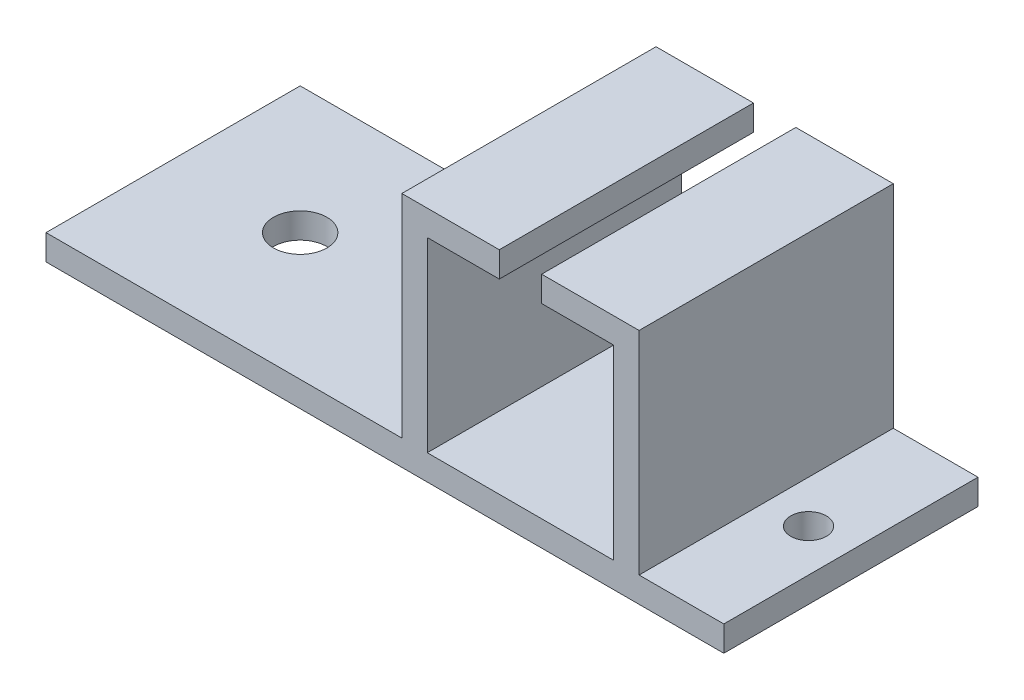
ISO-10303-21;
HEADER;
FILE_DESCRIPTION(('STEP AP214'),'2;1');
FILE_NAME('part.step','',(''),(''),'','','');
FILE_SCHEMA(('AUTOMOTIVE_DESIGN { 1 0 10303 214 1 1 1 1 }'));
ENDSEC;
DATA;
#1=APPLICATION_CONTEXT('core data for automotive mechanical design processes');
#2=APPLICATION_PROTOCOL_DEFINITION('international standard','automotive_design',2000,#1);
#3=PRODUCT_CONTEXT('',#1,'mechanical');
#4=PRODUCT('Part','Part','',(#3));
#5=PRODUCT_RELATED_PRODUCT_CATEGORY('part','',(#4));
#6=PRODUCT_DEFINITION_FORMATION('','',#4);
#7=PRODUCT_DEFINITION_CONTEXT('part definition',#1,'design');
#8=PRODUCT_DEFINITION('design','',#6,#7);
#9=PRODUCT_DEFINITION_SHAPE('','',#8);
#10=(LENGTH_UNIT() NAMED_UNIT(*) SI_UNIT(.MILLI.,.METRE.));
#11=(NAMED_UNIT(*) PLANE_ANGLE_UNIT() SI_UNIT($,.RADIAN.));
#12=(NAMED_UNIT(*) SI_UNIT($,.STERADIAN.) SOLID_ANGLE_UNIT());
#13=UNCERTAINTY_MEASURE_WITH_UNIT(LENGTH_MEASURE(1.E-05),#10,'distance_accuracy_value','');
#14=(GEOMETRIC_REPRESENTATION_CONTEXT(3) GLOBAL_UNCERTAINTY_ASSIGNED_CONTEXT((#13)) GLOBAL_UNIT_ASSIGNED_CONTEXT((#10,
#11,#12)) REPRESENTATION_CONTEXT('',''));
#15=CARTESIAN_POINT('',(0.,0.,0.));
#16=DIRECTION('',(0.,0.,1.));
#17=DIRECTION('',(1.,0.,0.));
#18=AXIS2_PLACEMENT_3D('',#15,#16,#17);
#19=CARTESIAN_POINT('',(0.,26.5,0.));
#20=DIRECTION('',(0.,1.,0.));
#21=DIRECTION('',(0.,0.,1.));
#22=AXIS2_PLACEMENT_3D('',#19,#20,#21);
#23=PLANE('',#22);
#24=DIRECTION('',(0.,0.,1.));
#25=VECTOR('',#24,1.);
#26=CARTESIAN_POINT('',(13.5,26.5,-15.));
#27=LINE('',#26,#25);
#28=CARTESIAN_POINT('',(13.5,26.5,-15.));
#29=VERTEX_POINT('',#28);
#30=CARTESIAN_POINT('',(13.5,26.5,15.));
#31=VERTEX_POINT('',#30);
#32=EDGE_CURVE('E154',#29,#31,#27,.T.);
#33=ORIENTED_EDGE('',*,*,#32,.F.);
#34=DIRECTION('',(-1.,0.,0.));
#35=VECTOR('',#34,1.);
#36=CARTESIAN_POINT('',(1.99999999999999,26.5,-15.));
#37=LINE('',#36,#35);
#38=CARTESIAN_POINT('',(1.99999999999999,26.5,-15.));
#39=VERTEX_POINT('',#38);
#40=EDGE_CURVE('E263',#29,#39,#37,.T.);
#41=ORIENTED_EDGE('',*,*,#40,.T.);
#42=DIRECTION('',(0.,0.,1.));
#43=VECTOR('',#42,1.);
#44=CARTESIAN_POINT('',(1.99999999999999,26.5,-15.));
#45=LINE('',#44,#43);
#46=CARTESIAN_POINT('',(1.99999999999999,26.5,15.));
#47=VERTEX_POINT('',#46);
#48=EDGE_CURVE('E170',#39,#47,#45,.T.);
#49=ORIENTED_EDGE('',*,*,#48,.T.);
#50=DIRECTION('',(1.,0.,0.));
#51=VECTOR('',#50,1.);
#52=CARTESIAN_POINT('',(1.99999999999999,26.5,15.));
#53=LINE('',#52,#51);
#54=EDGE_CURVE('E169',#47,#31,#53,.T.);
#55=ORIENTED_EDGE('',*,*,#54,.T.);
#56=EDGE_LOOP('',(#33,#41,#49,#55));
#57=FACE_BOUND('',#56,.T.);
#58=ADVANCED_FACE('F36',(#57),#23,.T.);
#59=CARTESIAN_POINT('',(4.99999999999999,23.5,-15.));
#60=DIRECTION('',(0.,1.,0.));
#61=DIRECTION('',(0.,0.,1.));
#62=AXIS2_PLACEMENT_3D('',#59,#60,#61);
#63=PLANE('',#62);
#64=DIRECTION('',(-1.,0.,0.));
#65=VECTOR('',#64,1.);
#66=CARTESIAN_POINT('',(4.99999999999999,23.5,-15.));
#67=LINE('',#66,#65);
#68=CARTESIAN_POINT('',(13.5,23.5,-15.));
#69=VERTEX_POINT('',#68);
#70=CARTESIAN_POINT('',(4.99999999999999,23.5,-15.));
#71=VERTEX_POINT('',#70);
#72=EDGE_CURVE('E238',#69,#71,#67,.T.);
#73=ORIENTED_EDGE('',*,*,#72,.F.);
#74=DIRECTION('',(0.,0.,1.));
#75=VECTOR('',#74,1.);
#76=CARTESIAN_POINT('',(13.5,23.5,-15.));
#77=LINE('',#76,#75);
#78=CARTESIAN_POINT('',(13.5,23.5,15.));
#79=VERTEX_POINT('',#78);
#80=EDGE_CURVE('E11',#69,#79,#77,.T.);
#81=ORIENTED_EDGE('',*,*,#80,.T.);
#82=DIRECTION('',(-1.,0.,0.));
#83=VECTOR('',#82,1.);
#84=CARTESIAN_POINT('',(4.99999999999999,23.5,15.));
#85=LINE('',#84,#83);
#86=CARTESIAN_POINT('',(4.99999999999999,23.5,15.));
#87=VERTEX_POINT('',#86);
#88=EDGE_CURVE('E255',#79,#87,#85,.T.);
#89=ORIENTED_EDGE('',*,*,#88,.T.);
#90=DIRECTION('',(0.,0.,1.));
#91=VECTOR('',#90,1.);
#92=CARTESIAN_POINT('',(4.99999999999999,23.5,-15.));
#93=LINE('',#92,#91);
#94=EDGE_CURVE('E180',#71,#87,#93,.T.);
#95=ORIENTED_EDGE('',*,*,#94,.F.);
#96=EDGE_LOOP('',(#73,#81,#89,#95));
#97=FACE_BOUND('',#96,.T.);
#98=ADVANCED_FACE('F310',(#97),#63,.F.);
#99=CARTESIAN_POINT('',(-40.,1.5,15.));
#100=DIRECTION('',(0.,-1.,0.));
#101=DIRECTION('',(0.,0.,-1.));
#102=AXIS2_PLACEMENT_3D('',#99,#100,#101);
#103=PLANE('',#102);
#104=CARTESIAN_POINT('',(35.,1.5,0.));
#105=DIRECTION('',(0.,1.,0.));
#106=DIRECTION('',(0.,0.,1.));
#107=AXIS2_PLACEMENT_3D('',#104,#105,#106);
#108=CIRCLE('',#107,2.1);
#109=CARTESIAN_POINT('',(35.,1.5,2.1));
#110=VERTEX_POINT('',#109);
#111=EDGE_CURVE('E288',#110,#110,#108,.T.);
#112=ORIENTED_EDGE('',*,*,#111,.F.);
#113=EDGE_LOOP('',(#112));
#114=FACE_BOUND('',#113,.T.);
#115=DIRECTION('',(0.,0.,-1.));
#116=VECTOR('',#115,1.);
#117=CARTESIAN_POINT('',(30.,1.5,-15.));
#118=LINE('',#117,#116);
#119=CARTESIAN_POINT('',(30.,1.5,15.));
#120=VERTEX_POINT('',#119);
#121=CARTESIAN_POINT('',(30.,1.5,-15.));
#122=VERTEX_POINT('',#121);
#123=EDGE_CURVE('E176',#120,#122,#118,.T.);
#124=ORIENTED_EDGE('',*,*,#123,.F.);
#125=DIRECTION('',(-1.,0.,0.));
#126=VECTOR('',#125,1.);
#127=CARTESIAN_POINT('',(-40.,1.5,15.));
#128=LINE('',#127,#126);
#129=CARTESIAN_POINT('',(40.,1.5,15.));
#130=VERTEX_POINT('',#129);
#131=EDGE_CURVE('E200',#130,#120,#128,.T.);
#132=ORIENTED_EDGE('',*,*,#131,.F.);
#133=DIRECTION('',(0.,0.,-1.));
#134=VECTOR('',#133,1.);
#135=CARTESIAN_POINT('',(40.,1.5,15.));
#136=LINE('',#135,#134);
#137=CARTESIAN_POINT('',(40.,1.5,-15.));
#138=VERTEX_POINT('',#137);
#139=EDGE_CURVE('E223',#130,#138,#136,.T.);
#140=ORIENTED_EDGE('',*,*,#139,.T.);
#141=DIRECTION('',(-1.,0.,0.));
#142=VECTOR('',#141,1.);
#143=CARTESIAN_POINT('',(-40.,1.5,-15.));
#144=LINE('',#143,#142);
#145=EDGE_CURVE('E210',#138,#122,#144,.T.);
#146=ORIENTED_EDGE('',*,*,#145,.T.);
#147=EDGE_LOOP('',(#124,#132,#140,#146));
#148=FACE_BOUND('',#147,.T.);
#149=ADVANCED_FACE('F324',(#114,#148),#103,.F.);
#150=CARTESIAN_POINT('',(-25.,1.5,0.));
#151=DIRECTION('',(0.,1.,0.));
#152=DIRECTION('',(0.,0.,1.));
#153=AXIS2_PLACEMENT_3D('',#150,#151,#152);
#154=CIRCLE('',#153,3.15);
#155=CARTESIAN_POINT('',(-25.,1.5,3.15));
#156=VERTEX_POINT('',#155);
#157=EDGE_CURVE('E277',#156,#156,#154,.T.);
#158=ORIENTED_EDGE('',*,*,#157,.F.);
#159=EDGE_LOOP('',(#158));
#160=FACE_BOUND('',#159,.T.);
#161=DIRECTION('',(0.,0.,1.));
#162=VECTOR('',#161,1.);
#163=CARTESIAN_POINT('',(1.99999999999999,1.5,-15.));
#164=LINE('',#163,#162);
#165=CARTESIAN_POINT('',(1.99999999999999,1.5,-15.));
#166=VERTEX_POINT('',#165);
#167=CARTESIAN_POINT('',(1.99999999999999,1.5,15.));
#168=VERTEX_POINT('',#167);
#169=EDGE_CURVE('E179',#166,#168,#164,.T.);
#170=ORIENTED_EDGE('',*,*,#169,.F.);
#171=CARTESIAN_POINT('',(-40.,1.5,-15.));
#172=VERTEX_POINT('',#171);
#173=EDGE_CURVE('E209',#166,#172,#144,.T.);
#174=ORIENTED_EDGE('',*,*,#173,.T.);
#175=DIRECTION('',(0.,0.,-1.));
#176=VECTOR('',#175,1.);
#177=CARTESIAN_POINT('',(-40.,1.5,15.));
#178=LINE('',#177,#176);
#179=CARTESIAN_POINT('',(-40.,1.5,15.));
#180=VERTEX_POINT('',#179);
#181=EDGE_CURVE('E220',#180,#172,#178,.T.);
#182=ORIENTED_EDGE('',*,*,#181,.F.);
#183=EDGE_CURVE('E198',#168,#180,#128,.T.);
#184=ORIENTED_EDGE('',*,*,#183,.F.);
#185=EDGE_LOOP('',(#170,#174,#182,#184));
#186=FACE_BOUND('',#185,.T.);
#187=ADVANCED_FACE('F352',(#160,#186),#103,.F.);
#188=CARTESIAN_POINT('',(40.,1.5,15.));
#189=DIRECTION('',(-1.,0.,0.));
#190=DIRECTION('',(0.,0.,1.));
#191=AXIS2_PLACEMENT_3D('',#188,#189,#190);
#192=PLANE('',#191);
#193=DIRECTION('',(0.,1.,0.));
#194=VECTOR('',#193,1.);
#195=CARTESIAN_POINT('',(40.,1.5,-15.));
#196=LINE('',#195,#194);
#197=CARTESIAN_POINT('',(40.,-1.5,-15.));
#198=VERTEX_POINT('',#197);
#199=EDGE_CURVE('E194',#198,#138,#196,.T.);
#200=ORIENTED_EDGE('',*,*,#199,.T.);
#201=ORIENTED_EDGE('',*,*,#139,.F.);
#202=DIRECTION('',(0.,1.,0.));
#203=VECTOR('',#202,1.);
#204=CARTESIAN_POINT('',(40.,1.5,15.));
#205=LINE('',#204,#203);
#206=CARTESIAN_POINT('',(40.,-1.5,15.));
#207=VERTEX_POINT('',#206);
#208=EDGE_CURVE('E195',#207,#130,#205,.T.);
#209=ORIENTED_EDGE('',*,*,#208,.F.);
#210=DIRECTION('',(0.,0.,-1.));
#211=VECTOR('',#210,1.);
#212=CARTESIAN_POINT('',(40.,-1.5,15.));
#213=LINE('',#212,#211);
#214=EDGE_CURVE('E206',#207,#198,#213,.T.);
#215=ORIENTED_EDGE('',*,*,#214,.T.);
#216=EDGE_LOOP('',(#200,#201,#209,#215));
#217=FACE_BOUND('',#216,.T.);
#218=ADVANCED_FACE('F38',(#217),#192,.F.);
#219=CARTESIAN_POINT('',(-40.,1.5,15.));
#220=DIRECTION('',(1.,0.,0.));
#221=DIRECTION('',(0.,0.,-1.));
#222=AXIS2_PLACEMENT_3D('',#219,#220,#221);
#223=PLANE('',#222);
#224=DIRECTION('',(0.,-1.,0.));
#225=VECTOR('',#224,1.);
#226=CARTESIAN_POINT('',(-40.,1.5,-15.));
#227=LINE('',#226,#225);
#228=CARTESIAN_POINT('',(-40.,-1.5,-15.));
#229=VERTEX_POINT('',#228);
#230=EDGE_CURVE('E212',#172,#229,#227,.T.);
#231=ORIENTED_EDGE('',*,*,#230,.T.);
#232=DIRECTION('',(0.,0.,-1.));
#233=VECTOR('',#232,1.);
#234=CARTESIAN_POINT('',(-40.,-1.5,15.));
#235=LINE('',#234,#233);
#236=CARTESIAN_POINT('',(-40.,-1.5,15.));
#237=VERTEX_POINT('',#236);
#238=EDGE_CURVE('E217',#237,#229,#235,.T.);
#239=ORIENTED_EDGE('',*,*,#238,.F.);
#240=DIRECTION('',(0.,-1.,0.));
#241=VECTOR('',#240,1.);
#242=CARTESIAN_POINT('',(-40.,1.5,15.));
#243=LINE('',#242,#241);
#244=EDGE_CURVE('E202',#180,#237,#243,.T.);
#245=ORIENTED_EDGE('',*,*,#244,.F.);
#246=ORIENTED_EDGE('',*,*,#181,.T.);
#247=EDGE_LOOP('',(#231,#239,#245,#246));
#248=FACE_BOUND('',#247,.T.);
#249=ADVANCED_FACE('F347',(#248),#223,.F.);
#250=CARTESIAN_POINT('',(-40.,-1.5,15.));
#251=DIRECTION('',(0.,1.,0.));
#252=DIRECTION('',(0.,0.,1.));
#253=AXIS2_PLACEMENT_3D('',#250,#251,#252);
#254=PLANE('',#253);
#255=CARTESIAN_POINT('',(-25.,-1.5,0.));
#256=DIRECTION('',(0.,1.,0.));
#257=DIRECTION('',(0.,0.,1.));
#258=AXIS2_PLACEMENT_3D('',#255,#256,#257);
#259=CIRCLE('',#258,3.15);
#260=CARTESIAN_POINT('',(-25.,-1.5,3.15));
#261=VERTEX_POINT('',#260);
#262=EDGE_CURVE('E281',#261,#261,#259,.T.);
#263=ORIENTED_EDGE('',*,*,#262,.T.);
#264=EDGE_LOOP('',(#263));
#265=FACE_BOUND('',#264,.T.);
#266=CARTESIAN_POINT('',(35.,-1.5,0.));
#267=DIRECTION('',(0.,1.,0.));
#268=DIRECTION('',(0.,0.,1.));
#269=AXIS2_PLACEMENT_3D('',#266,#267,#268);
#270=CIRCLE('',#269,2.1);
#271=CARTESIAN_POINT('',(35.,-1.5,2.1));
#272=VERTEX_POINT('',#271);
#273=EDGE_CURVE('E249',#272,#272,#270,.T.);
#274=ORIENTED_EDGE('',*,*,#273,.T.);
#275=EDGE_LOOP('',(#274));
#276=FACE_BOUND('',#275,.T.);
#277=DIRECTION('',(1.,0.,0.));
#278=VECTOR('',#277,1.);
#279=CARTESIAN_POINT('',(-40.,-1.5,-15.));
#280=LINE('',#279,#278);
#281=EDGE_CURVE('E199',#229,#198,#280,.T.);
#282=ORIENTED_EDGE('',*,*,#281,.T.);
#283=ORIENTED_EDGE('',*,*,#214,.F.);
#284=DIRECTION('',(1.,0.,0.));
#285=VECTOR('',#284,1.);
#286=CARTESIAN_POINT('',(-40.,-1.5,15.));
#287=LINE('',#286,#285);
#288=EDGE_CURVE('E204',#237,#207,#287,.T.);
#289=ORIENTED_EDGE('',*,*,#288,.F.);
#290=ORIENTED_EDGE('',*,*,#238,.T.);
#291=EDGE_LOOP('',(#282,#283,#289,#290));
#292=FACE_BOUND('',#291,.T.);
#293=ADVANCED_FACE('F342',(#265,#276,#292),#254,.F.);
#294=CARTESIAN_POINT('',(0.,0.,15.));
#295=DIRECTION('',(0.,0.,1.));
#296=DIRECTION('',(1.,0.,0.));
#297=AXIS2_PLACEMENT_3D('',#294,#295,#296);
#298=PLANE('',#297);
#299=DIRECTION('',(0.,1.,0.));
#300=VECTOR('',#299,1.);
#301=CARTESIAN_POINT('',(13.5,16.5,15.));
#302=LINE('',#301,#300);
#303=EDGE_CURVE('E59',#79,#31,#302,.T.);
#304=ORIENTED_EDGE('',*,*,#303,.T.);
#305=ORIENTED_EDGE('',*,*,#54,.F.);
#306=DIRECTION('',(0.,-1.,0.));
#307=VECTOR('',#306,1.);
#308=CARTESIAN_POINT('',(1.99999999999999,26.5,15.));
#309=LINE('',#308,#307);
#310=EDGE_CURVE('E185',#47,#168,#309,.T.);
#311=ORIENTED_EDGE('',*,*,#310,.T.);
#312=ORIENTED_EDGE('',*,*,#183,.T.);
#313=ORIENTED_EDGE('',*,*,#244,.T.);
#314=ORIENTED_EDGE('',*,*,#288,.T.);
#315=ORIENTED_EDGE('',*,*,#208,.T.);
#316=ORIENTED_EDGE('',*,*,#131,.T.);
#317=DIRECTION('',(0.,-1.,0.));
#318=VECTOR('',#317,1.);
#319=CARTESIAN_POINT('',(30.,26.5,15.));
#320=LINE('',#319,#318);
#321=CARTESIAN_POINT('',(30.,26.5,15.));
#322=VERTEX_POINT('',#321);
#323=EDGE_CURVE('E167',#322,#120,#320,.T.);
#324=ORIENTED_EDGE('',*,*,#323,.F.);
#325=CARTESIAN_POINT('',(18.5,26.5,15.));
#326=VERTEX_POINT('',#325);
#327=EDGE_CURVE('E160',#326,#322,#53,.T.);
#328=ORIENTED_EDGE('',*,*,#327,.F.);
#329=DIRECTION('',(0.,1.,0.));
#330=VECTOR('',#329,1.);
#331=CARTESIAN_POINT('',(18.5,16.5,15.));
#332=LINE('',#331,#330);
#333=CARTESIAN_POINT('',(18.5,23.5,15.));
#334=VERTEX_POINT('',#333);
#335=EDGE_CURVE('E146',#334,#326,#332,.T.);
#336=ORIENTED_EDGE('',*,*,#335,.F.);
#337=CARTESIAN_POINT('',(27.,23.5,15.));
#338=VERTEX_POINT('',#337);
#339=EDGE_CURVE('E231',#338,#334,#85,.T.);
#340=ORIENTED_EDGE('',*,*,#339,.F.);
#341=DIRECTION('',(0.,1.,0.));
#342=VECTOR('',#341,1.);
#343=CARTESIAN_POINT('',(27.,23.5,15.));
#344=LINE('',#343,#342);
#345=CARTESIAN_POINT('',(27.,1.5,15.));
#346=VERTEX_POINT('',#345);
#347=EDGE_CURVE('E252',#346,#338,#344,.T.);
#348=ORIENTED_EDGE('',*,*,#347,.F.);
#349=DIRECTION('',(1.,0.,0.));
#350=VECTOR('',#349,1.);
#351=CARTESIAN_POINT('',(5.,1.5,15.));
#352=LINE('',#351,#350);
#353=CARTESIAN_POINT('',(5.,1.5,15.));
#354=VERTEX_POINT('',#353);
#355=EDGE_CURVE('E248',#354,#346,#352,.T.);
#356=ORIENTED_EDGE('',*,*,#355,.F.);
#357=DIRECTION('',(0.,-1.,0.));
#358=VECTOR('',#357,1.);
#359=CARTESIAN_POINT('',(4.99999999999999,23.5,15.));
#360=LINE('',#359,#358);
#361=EDGE_CURVE('E246',#87,#354,#360,.T.);
#362=ORIENTED_EDGE('',*,*,#361,.F.);
#363=ORIENTED_EDGE('',*,*,#88,.F.);
#364=EDGE_LOOP('',(#304,#305,#311,#312,#313,#314,#315,#316,#324,#328,#336,#340,#348,#356,#362,#363));
#365=FACE_BOUND('',#364,.T.);
#366=ADVANCED_FACE('F164',(#365),#298,.T.);
#367=CARTESIAN_POINT('',(0.,0.,-15.));
#368=DIRECTION('',(0.,0.,1.));
#369=DIRECTION('',(1.,0.,0.));
#370=AXIS2_PLACEMENT_3D('',#367,#368,#369);
#371=PLANE('',#370);
#372=ORIENTED_EDGE('',*,*,#40,.F.);
#373=DIRECTION('',(0.,1.,0.));
#374=VECTOR('',#373,1.);
#375=CARTESIAN_POINT('',(13.5,16.5,-15.));
#376=LINE('',#375,#374);
#377=EDGE_CURVE('E278',#69,#29,#376,.T.);
#378=ORIENTED_EDGE('',*,*,#377,.F.);
#379=ORIENTED_EDGE('',*,*,#72,.T.);
#380=DIRECTION('',(0.,-1.,0.));
#381=VECTOR('',#380,1.);
#382=CARTESIAN_POINT('',(4.99999999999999,23.5,-15.));
#383=LINE('',#382,#381);
#384=CARTESIAN_POINT('',(5.,1.5,-15.));
#385=VERTEX_POINT('',#384);
#386=EDGE_CURVE('E257',#71,#385,#383,.T.);
#387=ORIENTED_EDGE('',*,*,#386,.T.);
#388=DIRECTION('',(1.,0.,0.));
#389=VECTOR('',#388,1.);
#390=CARTESIAN_POINT('',(5.,1.5,-15.));
#391=LINE('',#390,#389);
#392=CARTESIAN_POINT('',(27.,1.5,-15.));
#393=VERTEX_POINT('',#392);
#394=EDGE_CURVE('E295',#385,#393,#391,.T.);
#395=ORIENTED_EDGE('',*,*,#394,.T.);
#396=DIRECTION('',(0.,1.,0.));
#397=VECTOR('',#396,1.);
#398=CARTESIAN_POINT('',(27.,23.5,-15.));
#399=LINE('',#398,#397);
#400=CARTESIAN_POINT('',(27.,23.5,-15.));
#401=VERTEX_POINT('',#400);
#402=EDGE_CURVE('E236',#393,#401,#399,.T.);
#403=ORIENTED_EDGE('',*,*,#402,.T.);
#404=CARTESIAN_POINT('',(18.5,23.5,-15.));
#405=VERTEX_POINT('',#404);
#406=EDGE_CURVE('E229',#401,#405,#67,.T.);
#407=ORIENTED_EDGE('',*,*,#406,.T.);
#408=DIRECTION('',(0.,1.,0.));
#409=VECTOR('',#408,1.);
#410=CARTESIAN_POINT('',(18.5,16.5,-15.));
#411=LINE('',#410,#409);
#412=CARTESIAN_POINT('',(18.5,26.5,-15.));
#413=VERTEX_POINT('',#412);
#414=EDGE_CURVE('E51',#405,#413,#411,.T.);
#415=ORIENTED_EDGE('',*,*,#414,.T.);
#416=CARTESIAN_POINT('',(30.,26.5,-15.));
#417=VERTEX_POINT('',#416);
#418=EDGE_CURVE('E162',#417,#413,#37,.T.);
#419=ORIENTED_EDGE('',*,*,#418,.F.);
#420=DIRECTION('',(0.,-1.,0.));
#421=VECTOR('',#420,1.);
#422=CARTESIAN_POINT('',(30.,26.5,-15.));
#423=LINE('',#422,#421);
#424=EDGE_CURVE('E191',#417,#122,#423,.T.);
#425=ORIENTED_EDGE('',*,*,#424,.T.);
#426=ORIENTED_EDGE('',*,*,#145,.F.);
#427=ORIENTED_EDGE('',*,*,#199,.F.);
#428=ORIENTED_EDGE('',*,*,#281,.F.);
#429=ORIENTED_EDGE('',*,*,#230,.F.);
#430=ORIENTED_EDGE('',*,*,#173,.F.);
#431=DIRECTION('',(0.,-1.,0.));
#432=VECTOR('',#431,1.);
#433=CARTESIAN_POINT('',(1.99999999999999,26.5,-15.));
#434=LINE('',#433,#432);
#435=EDGE_CURVE('E188',#39,#166,#434,.T.);
#436=ORIENTED_EDGE('',*,*,#435,.F.);
#437=EDGE_LOOP('',(#372,#378,#379,#387,#395,#403,#407,#415,#419,#425,#426,#427,#428,#429,#430,#436));
#438=FACE_BOUND('',#437,.T.);
#439=ADVANCED_FACE('F234',(#438),#371,.F.);
#440=CARTESIAN_POINT('',(30.,26.5,-15.));
#441=DIRECTION('',(-1.,0.,0.));
#442=DIRECTION('',(0.,0.,1.));
#443=AXIS2_PLACEMENT_3D('',#440,#441,#442);
#444=PLANE('',#443);
#445=ORIENTED_EDGE('',*,*,#123,.T.);
#446=ORIENTED_EDGE('',*,*,#424,.F.);
#447=DIRECTION('',(0.,0.,-1.));
#448=VECTOR('',#447,1.);
#449=CARTESIAN_POINT('',(30.,26.5,-15.));
#450=LINE('',#449,#448);
#451=EDGE_CURVE('E183',#322,#417,#450,.T.);
#452=ORIENTED_EDGE('',*,*,#451,.F.);
#453=ORIENTED_EDGE('',*,*,#323,.T.);
#454=EDGE_LOOP('',(#445,#446,#452,#453));
#455=FACE_BOUND('',#454,.T.);
#456=ADVANCED_FACE('F333',(#455),#444,.F.);
#457=CARTESIAN_POINT('',(1.99999999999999,26.5,-15.));
#458=DIRECTION('',(1.,0.,0.));
#459=DIRECTION('',(0.,0.,-1.));
#460=AXIS2_PLACEMENT_3D('',#457,#458,#459);
#461=PLANE('',#460);
#462=ORIENTED_EDGE('',*,*,#169,.T.);
#463=ORIENTED_EDGE('',*,*,#310,.F.);
#464=ORIENTED_EDGE('',*,*,#48,.F.);
#465=ORIENTED_EDGE('',*,*,#435,.T.);
#466=EDGE_LOOP('',(#462,#463,#464,#465));
#467=FACE_BOUND('',#466,.T.);
#468=ADVANCED_FACE('F273',(#467),#461,.F.);
#469=DIRECTION('',(0.,0.,-1.));
#470=VECTOR('',#469,1.);
#471=CARTESIAN_POINT('',(18.5,26.5,-15.));
#472=LINE('',#471,#470);
#473=EDGE_CURVE('E149',#326,#413,#472,.T.);
#474=ORIENTED_EDGE('',*,*,#473,.F.);
#475=ORIENTED_EDGE('',*,*,#327,.T.);
#476=ORIENTED_EDGE('',*,*,#451,.T.);
#477=ORIENTED_EDGE('',*,*,#418,.T.);
#478=EDGE_LOOP('',(#474,#475,#476,#477));
#479=FACE_BOUND('',#478,.T.);
#480=ADVANCED_FACE('F158',(#479),#23,.T.);
#481=CARTESIAN_POINT('',(4.99999999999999,23.5,-15.));
#482=DIRECTION('',(-1.,0.,0.));
#483=DIRECTION('',(0.,-1.,0.));
#484=AXIS2_PLACEMENT_3D('',#481,#482,#483);
#485=PLANE('',#484);
#486=ORIENTED_EDGE('',*,*,#361,.T.);
#487=DIRECTION('',(0.,0.,1.));
#488=VECTOR('',#487,1.);
#489=CARTESIAN_POINT('',(5.,1.5,-15.));
#490=LINE('',#489,#488);
#491=EDGE_CURVE('E237',#385,#354,#490,.T.);
#492=ORIENTED_EDGE('',*,*,#491,.F.);
#493=ORIENTED_EDGE('',*,*,#386,.F.);
#494=ORIENTED_EDGE('',*,*,#94,.T.);
#495=EDGE_LOOP('',(#486,#492,#493,#494));
#496=FACE_BOUND('',#495,.T.);
#497=ADVANCED_FACE('F306',(#496),#485,.F.);
#498=ORIENTED_EDGE('',*,*,#339,.T.);
#499=DIRECTION('',(0.,0.,-1.));
#500=VECTOR('',#499,1.);
#501=CARTESIAN_POINT('',(18.5,23.5,-15.));
#502=LINE('',#501,#500);
#503=EDGE_CURVE('E44',#334,#405,#502,.T.);
#504=ORIENTED_EDGE('',*,*,#503,.T.);
#505=ORIENTED_EDGE('',*,*,#406,.F.);
#506=DIRECTION('',(0.,0.,1.));
#507=VECTOR('',#506,1.);
#508=CARTESIAN_POINT('',(27.,23.5,-15.));
#509=LINE('',#508,#507);
#510=EDGE_CURVE('E260',#401,#338,#509,.T.);
#511=ORIENTED_EDGE('',*,*,#510,.T.);
#512=EDGE_LOOP('',(#498,#504,#505,#511));
#513=FACE_BOUND('',#512,.T.);
#514=ADVANCED_FACE('F228',(#513),#63,.F.);
#515=CARTESIAN_POINT('',(27.,23.5,-15.));
#516=DIRECTION('',(1.,0.,0.));
#517=DIRECTION('',(0.,1.,0.));
#518=AXIS2_PLACEMENT_3D('',#515,#516,#517);
#519=PLANE('',#518);
#520=ORIENTED_EDGE('',*,*,#347,.T.);
#521=ORIENTED_EDGE('',*,*,#510,.F.);
#522=ORIENTED_EDGE('',*,*,#402,.F.);
#523=DIRECTION('',(0.,0.,1.));
#524=VECTOR('',#523,1.);
#525=CARTESIAN_POINT('',(27.,1.5,-15.));
#526=LINE('',#525,#524);
#527=EDGE_CURVE('E241',#393,#346,#526,.T.);
#528=ORIENTED_EDGE('',*,*,#527,.T.);
#529=EDGE_LOOP('',(#520,#521,#522,#528));
#530=FACE_BOUND('',#529,.T.);
#531=ADVANCED_FACE('F304',(#530),#519,.F.);
#532=CARTESIAN_POINT('',(5.,1.5,-15.));
#533=DIRECTION('',(0.,-1.,0.));
#534=DIRECTION('',(1.,0.,0.));
#535=AXIS2_PLACEMENT_3D('',#532,#533,#534);
#536=PLANE('',#535);
#537=ORIENTED_EDGE('',*,*,#355,.T.);
#538=ORIENTED_EDGE('',*,*,#527,.F.);
#539=ORIENTED_EDGE('',*,*,#394,.F.);
#540=ORIENTED_EDGE('',*,*,#491,.T.);
#541=EDGE_LOOP('',(#537,#538,#539,#540));
#542=FACE_BOUND('',#541,.T.);
#543=ADVANCED_FACE('F300',(#542),#536,.F.);
#544=CARTESIAN_POINT('',(35.,-1.5,0.));
#545=DIRECTION('',(0.,1.,0.));
#546=DIRECTION('',(0.,0.,1.));
#547=AXIS2_PLACEMENT_3D('',#544,#545,#546);
#548=CYLINDRICAL_SURFACE('',#547,2.1);
#549=ORIENTED_EDGE('',*,*,#273,.F.);
#550=EDGE_LOOP('',(#549));
#551=FACE_BOUND('',#550,.T.);
#552=ORIENTED_EDGE('',*,*,#111,.T.);
#553=EDGE_LOOP('',(#552));
#554=FACE_BOUND('',#553,.T.);
#555=ADVANCED_FACE('F429',(#551,#554),#548,.F.);
#556=CARTESIAN_POINT('',(-25.,-1.5,0.));
#557=DIRECTION('',(0.,1.,0.));
#558=DIRECTION('',(0.,0.,1.));
#559=AXIS2_PLACEMENT_3D('',#556,#557,#558);
#560=CYLINDRICAL_SURFACE('',#559,3.15);
#561=ORIENTED_EDGE('',*,*,#262,.F.);
#562=EDGE_LOOP('',(#561));
#563=FACE_BOUND('',#562,.T.);
#564=ORIENTED_EDGE('',*,*,#157,.T.);
#565=EDGE_LOOP('',(#564));
#566=FACE_BOUND('',#565,.T.);
#567=ADVANCED_FACE('F317',(#563,#566),#560,.F.);
#568=CARTESIAN_POINT('',(18.5,16.5,-15.));
#569=DIRECTION('',(1.,0.,0.));
#570=DIRECTION('',(0.,0.,-1.));
#571=AXIS2_PLACEMENT_3D('',#568,#569,#570);
#572=PLANE('',#571);
#573=ORIENTED_EDGE('',*,*,#335,.T.);
#574=ORIENTED_EDGE('',*,*,#473,.T.);
#575=ORIENTED_EDGE('',*,*,#414,.F.);
#576=ORIENTED_EDGE('',*,*,#503,.F.);
#577=EDGE_LOOP('',(#573,#574,#575,#576));
#578=FACE_BOUND('',#577,.T.);
#579=ADVANCED_FACE('F148',(#578),#572,.F.);
#580=CARTESIAN_POINT('',(13.5,16.5,-15.));
#581=DIRECTION('',(-1.,0.,0.));
#582=DIRECTION('',(0.,0.,1.));
#583=AXIS2_PLACEMENT_3D('',#580,#581,#582);
#584=PLANE('',#583);
#585=ORIENTED_EDGE('',*,*,#377,.T.);
#586=ORIENTED_EDGE('',*,*,#32,.T.);
#587=ORIENTED_EDGE('',*,*,#303,.F.);
#588=ORIENTED_EDGE('',*,*,#80,.F.);
#589=EDGE_LOOP('',(#585,#586,#587,#588));
#590=FACE_BOUND('',#589,.T.);
#591=ADVANCED_FACE('F311',(#590),#584,.F.);
#592=CLOSED_SHELL('',(#58,#98,#149,#187,#218,#249,#293,#366,#439,#456,#468,#480,#497,#514,#531,
#543,#555,#567,#579,#591));
#593=MANIFOLD_SOLID_BREP('B2',#592);
#594=ADVANCED_BREP_SHAPE_REPRESENTATION('',(#18,#593),#14);
#595=SHAPE_DEFINITION_REPRESENTATION(#9,#594);
ENDSEC;
END-ISO-10303-21;
